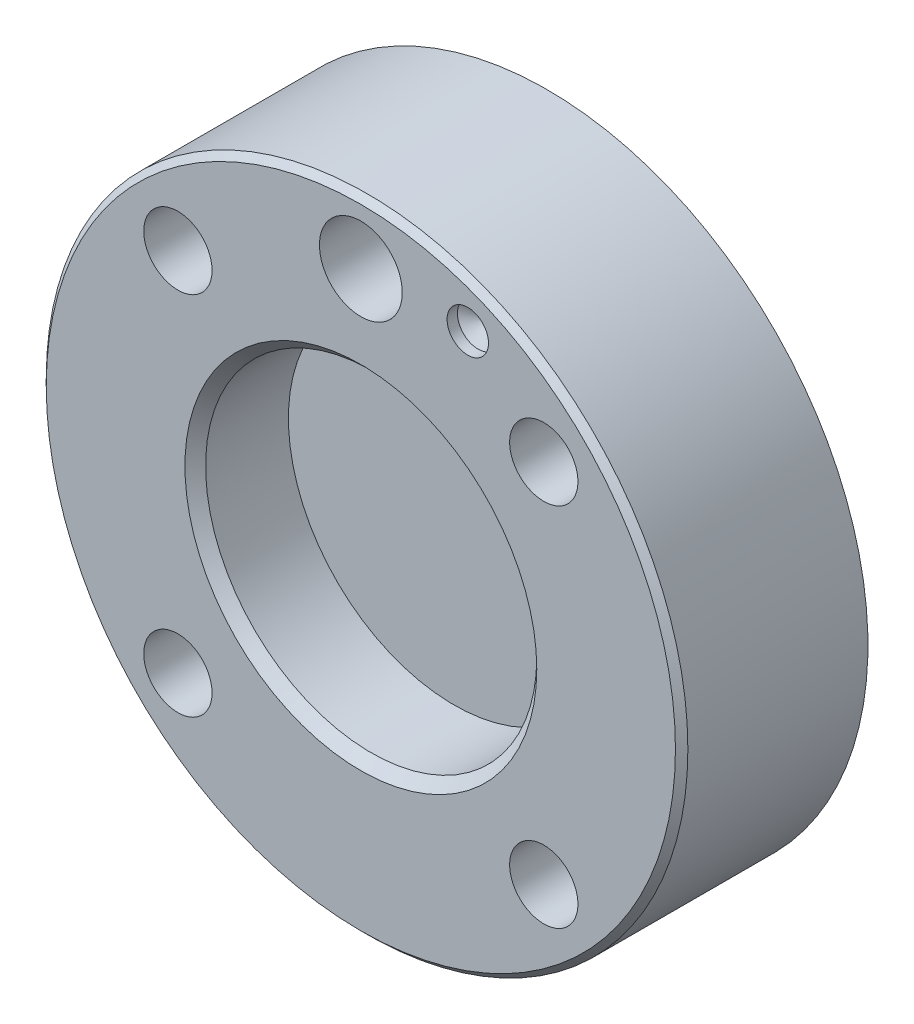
ISO-10303-21;
HEADER;
FILE_DESCRIPTION(('STEP AP214'),'2;1');
FILE_NAME('part.step','',(''),(''),'','','');
FILE_SCHEMA(('AUTOMOTIVE_DESIGN { 1 0 10303 214 1 1 1 1 }'));
ENDSEC;
DATA;
#1=APPLICATION_CONTEXT('core data for automotive mechanical design processes');
#2=APPLICATION_PROTOCOL_DEFINITION('international standard','automotive_design',2000,#1);
#3=PRODUCT_CONTEXT('',#1,'mechanical');
#4=PRODUCT('Part','Part','',(#3));
#5=PRODUCT_RELATED_PRODUCT_CATEGORY('part','',(#4));
#6=PRODUCT_DEFINITION_FORMATION('','',#4);
#7=PRODUCT_DEFINITION_CONTEXT('part definition',#1,'design');
#8=PRODUCT_DEFINITION('design','',#6,#7);
#9=PRODUCT_DEFINITION_SHAPE('','',#8);
#10=(LENGTH_UNIT() NAMED_UNIT(*) SI_UNIT(.MILLI.,.METRE.));
#11=(NAMED_UNIT(*) PLANE_ANGLE_UNIT() SI_UNIT($,.RADIAN.));
#12=(NAMED_UNIT(*) SI_UNIT($,.STERADIAN.) SOLID_ANGLE_UNIT());
#13=UNCERTAINTY_MEASURE_WITH_UNIT(LENGTH_MEASURE(1.E-05),#10,'distance_accuracy_value','');
#14=(GEOMETRIC_REPRESENTATION_CONTEXT(3) GLOBAL_UNCERTAINTY_ASSIGNED_CONTEXT((#13)) GLOBAL_UNIT_ASSIGNED_CONTEXT((#10,
#11,#12)) REPRESENTATION_CONTEXT('',''));
#15=CARTESIAN_POINT('',(0.,0.,0.));
#16=DIRECTION('',(0.,0.,1.));
#17=DIRECTION('',(1.,0.,0.));
#18=AXIS2_PLACEMENT_3D('',#15,#16,#17);
#19=CARTESIAN_POINT('',(5.5,0.,31.5));
#20=DIRECTION('',(0.,0.,1.));
#21=DIRECTION('',(1.,0.,0.));
#22=AXIS2_PLACEMENT_3D('',#19,#20,#21);
#23=PLANE('',#22);
#24=CARTESIAN_POINT('',(0.,0.,31.5));
#25=DIRECTION('',(0.,0.,1.));
#26=DIRECTION('',(1.,0.,0.));
#27=AXIS2_PLACEMENT_3D('',#24,#25,#26);
#28=CIRCLE('',#27,8.);
#29=CARTESIAN_POINT('',(7.99999999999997,0.,31.5));
#30=VERTEX_POINT('',#29);
#31=EDGE_CURVE('E41',#30,#30,#28,.T.);
#32=ORIENTED_EDGE('',*,*,#31,.T.);
#33=EDGE_LOOP('',(#32));
#34=FACE_BOUND('',#33,.T.);
#35=ADVANCED_FACE('F38',(#34),#23,.T.);
#36=CARTESIAN_POINT('',(0.,0.,11.5));
#37=DIRECTION('',(0.,0.,1.));
#38=DIRECTION('',(1.,0.,0.));
#39=AXIS2_PLACEMENT_3D('',#36,#37,#38);
#40=CYLINDRICAL_SURFACE('',#39,8.);
#41=ORIENTED_EDGE('',*,*,#31,.F.);
#42=EDGE_LOOP('',(#41));
#43=FACE_BOUND('',#42,.T.);
#44=CARTESIAN_POINT('',(0.,0.,35.5));
#45=DIRECTION('',(0.,0.,1.));
#46=DIRECTION('',(1.,0.,0.));
#47=AXIS2_PLACEMENT_3D('',#44,#45,#46);
#48=CIRCLE('',#47,8.);
#49=CARTESIAN_POINT('',(7.99999999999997,0.,35.5));
#50=VERTEX_POINT('',#49);
#51=EDGE_CURVE('E116',#50,#50,#48,.T.);
#52=ORIENTED_EDGE('',*,*,#51,.T.);
#53=EDGE_LOOP('',(#52));
#54=FACE_BOUND('',#53,.T.);
#55=ADVANCED_FACE('F130',(#43,#54),#40,.F.);
#56=CARTESIAN_POINT('',(0.,0.,36.0000000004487));
#57=DIRECTION('',(0.,0.,1.));
#58=DIRECTION('',(1.,0.,0.));
#59=AXIS2_PLACEMENT_3D('',#56,#57,#58);
#60=CONICAL_SURFACE('',#59,8.49999999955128,0.785398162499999);
#61=ORIENTED_EDGE('',*,*,#51,.F.);
#62=EDGE_LOOP('',(#61));
#63=FACE_BOUND('',#62,.T.);
#64=CARTESIAN_POINT('',(0.,0.,36.0000000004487));
#65=DIRECTION('',(0.,0.,1.));
#66=DIRECTION('',(1.,0.,0.));
#67=AXIS2_PLACEMENT_3D('',#64,#65,#66);
#68=CIRCLE('',#67,8.49999999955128);
#69=CARTESIAN_POINT('',(8.49999999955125,0.,36.0000000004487));
#70=VERTEX_POINT('',#69);
#71=EDGE_CURVE('E119',#70,#70,#68,.F.);
#72=ORIENTED_EDGE('',*,*,#71,.F.);
#73=EDGE_LOOP('',(#72));
#74=FACE_BOUND('',#73,.T.);
#75=ADVANCED_FACE('F128',(#63,#74),#60,.F.);
#76=CARTESIAN_POINT('',(8.,0.,36.));
#77=DIRECTION('',(0.,0.,1.));
#78=DIRECTION('',(1.,0.,0.));
#79=AXIS2_PLACEMENT_3D('',#76,#77,#78);
#80=PLANE('',#79);
#81=CARTESIAN_POINT('',(0.,12.5000000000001,36.));
#82=DIRECTION('',(0.,0.,1.));
#83=DIRECTION('',(1.,0.,0.));
#84=AXIS2_PLACEMENT_3D('',#81,#82,#83);
#85=CIRCLE('',#84,1.99999999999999);
#86=CARTESIAN_POINT('',(1.99999999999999,12.5000000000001,36.));
#87=VERTEX_POINT('',#86);
#88=EDGE_CURVE('E77',#87,#87,#85,.T.);
#89=ORIENTED_EDGE('',*,*,#88,.F.);
#90=EDGE_LOOP('',(#89));
#91=FACE_BOUND('',#90,.T.);
#92=CARTESIAN_POINT('',(-8.83883476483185,8.83883476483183,36.));
#93=DIRECTION('',(0.,0.,1.));
#94=DIRECTION('',(1.,0.,0.));
#95=AXIS2_PLACEMENT_3D('',#92,#93,#94);
#96=CIRCLE('',#95,1.64999999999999);
#97=CARTESIAN_POINT('',(-7.18883476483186,8.83883476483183,36.));
#98=VERTEX_POINT('',#97);
#99=EDGE_CURVE('E76',#98,#98,#96,.T.);
#100=ORIENTED_EDGE('',*,*,#99,.F.);
#101=EDGE_LOOP('',(#100));
#102=FACE_BOUND('',#101,.T.);
#103=CARTESIAN_POINT('',(8.83883476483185,8.83883476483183,36.0000000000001));
#104=DIRECTION('',(0.,0.,1.));
#105=DIRECTION('',(1.,0.,0.));
#106=AXIS2_PLACEMENT_3D('',#103,#104,#105);
#107=CIRCLE('',#106,1.64999999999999);
#108=CARTESIAN_POINT('',(10.4888347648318,8.83883476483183,36.0000000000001));
#109=VERTEX_POINT('',#108);
#110=EDGE_CURVE('E87',#109,#109,#107,.T.);
#111=ORIENTED_EDGE('',*,*,#110,.F.);
#112=EDGE_LOOP('',(#111));
#113=FACE_BOUND('',#112,.T.);
#114=CARTESIAN_POINT('',(8.83883476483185,-8.83883476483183,36.));
#115=DIRECTION('',(0.,0.,1.));
#116=DIRECTION('',(1.,0.,0.));
#117=AXIS2_PLACEMENT_3D('',#114,#115,#116);
#118=CIRCLE('',#117,1.64999999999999);
#119=CARTESIAN_POINT('',(10.4888347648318,-8.83883476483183,36.));
#120=VERTEX_POINT('',#119);
#121=EDGE_CURVE('E93',#120,#120,#118,.T.);
#122=ORIENTED_EDGE('',*,*,#121,.F.);
#123=EDGE_LOOP('',(#122));
#124=FACE_BOUND('',#123,.T.);
#125=CARTESIAN_POINT('',(-8.83883476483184,-8.83883476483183,36.));
#126=DIRECTION('',(0.,0.,1.));
#127=DIRECTION('',(1.,0.,0.));
#128=AXIS2_PLACEMENT_3D('',#125,#126,#127);
#129=CIRCLE('',#128,1.64999999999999);
#130=CARTESIAN_POINT('',(-7.18883476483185,-8.83883476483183,36.));
#131=VERTEX_POINT('',#130);
#132=EDGE_CURVE('E99',#131,#131,#129,.T.);
#133=ORIENTED_EDGE('',*,*,#132,.F.);
#134=EDGE_LOOP('',(#133));
#135=FACE_BOUND('',#134,.T.);
#136=CARTESIAN_POINT('',(5.16622633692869,12.4723736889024,36.));
#137=DIRECTION('',(0.,0.,1.));
#138=DIRECTION('',(1.,0.,0.));
#139=AXIS2_PLACEMENT_3D('',#136,#137,#138);
#140=CIRCLE('',#139,1.);
#141=CARTESIAN_POINT('',(6.16622633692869,12.4723736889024,36.));
#142=VERTEX_POINT('',#141);
#143=EDGE_CURVE('E108',#142,#142,#140,.T.);
#144=ORIENTED_EDGE('',*,*,#143,.F.);
#145=EDGE_LOOP('',(#144));
#146=FACE_BOUND('',#145,.T.);
#147=CARTESIAN_POINT('',(0.,0.,36.));
#148=DIRECTION('',(0.,0.,-1.));
#149=DIRECTION('',(-1.,0.,0.));
#150=AXIS2_PLACEMENT_3D('',#147,#148,#149);
#151=CIRCLE('',#150,15.2);
#152=CARTESIAN_POINT('',(-15.2,0.,36.));
#153=VERTEX_POINT('',#152);
#154=EDGE_CURVE('E46',#153,#153,#151,.T.);
#155=ORIENTED_EDGE('',*,*,#154,.F.);
#156=EDGE_LOOP('',(#155));
#157=FACE_BOUND('',#156,.T.);
#158=ORIENTED_EDGE('',*,*,#71,.T.);
#159=EDGE_LOOP('',(#158));
#160=FACE_BOUND('',#159,.T.);
#161=ADVANCED_FACE('F126',(#91,#102,#113,#124,#135,#146,#157,#160),#80,.T.);
#162=CARTESIAN_POINT('',(0.,0.,35.6999999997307));
#163=DIRECTION('',(0.,0.,-1.));
#164=DIRECTION('',(-1.,0.,0.));
#165=AXIS2_PLACEMENT_3D('',#162,#163,#164);
#166=CONICAL_SURFACE('',#165,15.4999999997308,0.7853981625);
#167=ORIENTED_EDGE('',*,*,#154,.T.);
#168=EDGE_LOOP('',(#167));
#169=FACE_BOUND('',#168,.T.);
#170=CARTESIAN_POINT('',(0.,0.,35.7));
#171=DIRECTION('',(0.,0.,1.));
#172=DIRECTION('',(1.,0.,0.));
#173=AXIS2_PLACEMENT_3D('',#170,#171,#172);
#174=CIRCLE('',#173,15.5);
#175=CARTESIAN_POINT('',(15.5,0.,35.7));
#176=VERTEX_POINT('',#175);
#177=EDGE_CURVE('E11',#176,#176,#174,.F.);
#178=ORIENTED_EDGE('',*,*,#177,.F.);
#179=EDGE_LOOP('',(#178));
#180=FACE_BOUND('',#179,.T.);
#181=ADVANCED_FACE('F137',(#169,#180),#166,.T.);
#182=CARTESIAN_POINT('',(0.,0.,11.5));
#183=DIRECTION('',(0.,0.,1.));
#184=DIRECTION('',(1.,0.,0.));
#185=AXIS2_PLACEMENT_3D('',#182,#183,#184);
#186=CYLINDRICAL_SURFACE('',#185,15.5);
#187=ORIENTED_EDGE('',*,*,#177,.T.);
#188=EDGE_LOOP('',(#187));
#189=FACE_BOUND('',#188,.T.);
#190=CARTESIAN_POINT('',(0.,0.,27.));
#191=DIRECTION('',(0.,0.,-1.));
#192=DIRECTION('',(-1.,0.,0.));
#193=AXIS2_PLACEMENT_3D('',#190,#191,#192);
#194=CIRCLE('',#193,15.5);
#195=CARTESIAN_POINT('',(-15.5,0.,27.));
#196=VERTEX_POINT('',#195);
#197=EDGE_CURVE('E105',#196,#196,#194,.T.);
#198=ORIENTED_EDGE('',*,*,#197,.F.);
#199=EDGE_LOOP('',(#198));
#200=FACE_BOUND('',#199,.T.);
#201=ADVANCED_FACE('F142',(#189,#200),#186,.T.);
#202=CARTESIAN_POINT('',(5.16622633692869,12.4723736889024,35.5));
#203=DIRECTION('',(0.,0.,1.));
#204=DIRECTION('',(1.,0.,0.));
#205=AXIS2_PLACEMENT_3D('',#202,#203,#204);
#206=CONICAL_SURFACE('',#205,1.,1.02974425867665);
#207=CARTESIAN_POINT('',(5.16622633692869,12.4723736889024,34.8991393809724));
#208=VERTEX_POINT('',#207);
#209=VERTEX_LOOP('',#208);
#210=FACE_BOUND('',#209,.T.);
#211=CARTESIAN_POINT('',(5.16622633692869,12.4723736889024,35.5));
#212=DIRECTION('',(0.,0.,1.));
#213=DIRECTION('',(1.,0.,0.));
#214=AXIS2_PLACEMENT_3D('',#211,#212,#213);
#215=CIRCLE('',#214,1.);
#216=CARTESIAN_POINT('',(6.16622633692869,12.4723736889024,35.5));
#217=VERTEX_POINT('',#216);
#218=EDGE_CURVE('E111',#217,#217,#215,.T.);
#219=ORIENTED_EDGE('',*,*,#218,.T.);
#220=EDGE_LOOP('',(#219));
#221=FACE_BOUND('',#220,.T.);
#222=ADVANCED_FACE('F144',(#210,#221),#206,.F.);
#223=CARTESIAN_POINT('',(5.16622633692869,12.4723736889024,36.));
#224=DIRECTION('',(0.,0.,1.));
#225=DIRECTION('',(1.,0.,0.));
#226=AXIS2_PLACEMENT_3D('',#223,#224,#225);
#227=CYLINDRICAL_SURFACE('',#226,1.);
#228=ORIENTED_EDGE('',*,*,#218,.F.);
#229=EDGE_LOOP('',(#228));
#230=FACE_BOUND('',#229,.T.);
#231=ORIENTED_EDGE('',*,*,#143,.T.);
#232=EDGE_LOOP('',(#231));
#233=FACE_BOUND('',#232,.T.);
#234=ADVANCED_FACE('F151',(#230,#233),#227,.F.);
#235=CARTESIAN_POINT('',(0.,15.5,27.));
#236=DIRECTION('',(0.,0.,1.));
#237=DIRECTION('',(1.,0.,0.));
#238=AXIS2_PLACEMENT_3D('',#235,#236,#237);
#239=PLANE('',#238);
#240=ORIENTED_EDGE('',*,*,#197,.T.);
#241=EDGE_LOOP('',(#240));
#242=FACE_BOUND('',#241,.T.);
#243=ADVANCED_FACE('F159',(#242),#239,.F.);
#244=CARTESIAN_POINT('',(-8.83883476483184,-8.83883476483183,28.5));
#245=DIRECTION('',(0.,0.,1.));
#246=DIRECTION('',(1.,0.,0.));
#247=AXIS2_PLACEMENT_3D('',#244,#245,#246);
#248=CONICAL_SURFACE('',#247,1.65,1.02974425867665);
#249=CARTESIAN_POINT('',(-8.83883476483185,-8.83883476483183,27.5085799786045));
#250=VERTEX_POINT('',#249);
#251=VERTEX_LOOP('',#250);
#252=FACE_BOUND('',#251,.T.);
#253=CARTESIAN_POINT('',(-8.83883476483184,-8.83883476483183,28.5));
#254=DIRECTION('',(0.,0.,1.));
#255=DIRECTION('',(1.,0.,0.));
#256=AXIS2_PLACEMENT_3D('',#253,#254,#255);
#257=CIRCLE('',#256,1.65);
#258=CARTESIAN_POINT('',(-7.18883476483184,-8.83883476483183,28.5));
#259=VERTEX_POINT('',#258);
#260=EDGE_CURVE('E102',#259,#259,#257,.T.);
#261=ORIENTED_EDGE('',*,*,#260,.T.);
#262=EDGE_LOOP('',(#261));
#263=FACE_BOUND('',#262,.T.);
#264=ADVANCED_FACE('F163',(#252,#263),#248,.F.);
#265=CARTESIAN_POINT('',(-8.83883476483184,-8.83883476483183,36.));
#266=DIRECTION('',(0.,0.,1.));
#267=DIRECTION('',(1.,0.,0.));
#268=AXIS2_PLACEMENT_3D('',#265,#266,#267);
#269=CYLINDRICAL_SURFACE('',#268,1.64999999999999);
#270=ORIENTED_EDGE('',*,*,#260,.F.);
#271=EDGE_LOOP('',(#270));
#272=FACE_BOUND('',#271,.T.);
#273=ORIENTED_EDGE('',*,*,#132,.T.);
#274=EDGE_LOOP('',(#273));
#275=FACE_BOUND('',#274,.T.);
#276=ADVANCED_FACE('F167',(#272,#275),#269,.F.);
#277=CARTESIAN_POINT('',(8.83883476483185,-8.83883476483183,28.5));
#278=DIRECTION('',(0.,0.,1.));
#279=DIRECTION('',(1.,0.,0.));
#280=AXIS2_PLACEMENT_3D('',#277,#278,#279);
#281=CONICAL_SURFACE('',#280,1.65,1.02974425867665);
#282=CARTESIAN_POINT('',(8.83883476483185,-8.83883476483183,27.5085799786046));
#283=VERTEX_POINT('',#282);
#284=VERTEX_LOOP('',#283);
#285=FACE_BOUND('',#284,.T.);
#286=CARTESIAN_POINT('',(8.83883476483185,-8.83883476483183,28.5));
#287=DIRECTION('',(0.,0.,1.));
#288=DIRECTION('',(1.,0.,0.));
#289=AXIS2_PLACEMENT_3D('',#286,#287,#288);
#290=CIRCLE('',#289,1.65);
#291=CARTESIAN_POINT('',(10.4888347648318,-8.83883476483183,28.5));
#292=VERTEX_POINT('',#291);
#293=EDGE_CURVE('E96',#292,#292,#290,.T.);
#294=ORIENTED_EDGE('',*,*,#293,.T.);
#295=EDGE_LOOP('',(#294));
#296=FACE_BOUND('',#295,.T.);
#297=ADVANCED_FACE('F170',(#285,#296),#281,.F.);
#298=CARTESIAN_POINT('',(8.83883476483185,-8.83883476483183,36.));
#299=DIRECTION('',(0.,0.,1.));
#300=DIRECTION('',(1.,0.,0.));
#301=AXIS2_PLACEMENT_3D('',#298,#299,#300);
#302=CYLINDRICAL_SURFACE('',#301,1.64999999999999);
#303=ORIENTED_EDGE('',*,*,#293,.F.);
#304=EDGE_LOOP('',(#303));
#305=FACE_BOUND('',#304,.T.);
#306=ORIENTED_EDGE('',*,*,#121,.T.);
#307=EDGE_LOOP('',(#306));
#308=FACE_BOUND('',#307,.T.);
#309=ADVANCED_FACE('F174',(#305,#308),#302,.F.);
#310=CARTESIAN_POINT('',(8.83883476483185,8.83883476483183,28.5000000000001));
#311=DIRECTION('',(0.,0.,1.));
#312=DIRECTION('',(1.,0.,0.));
#313=AXIS2_PLACEMENT_3D('',#310,#311,#312);
#314=CONICAL_SURFACE('',#313,1.65,1.02974425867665);
#315=CARTESIAN_POINT('',(8.83883476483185,8.83883476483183,27.5085799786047));
#316=VERTEX_POINT('',#315);
#317=VERTEX_LOOP('',#316);
#318=FACE_BOUND('',#317,.T.);
#319=CARTESIAN_POINT('',(8.83883476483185,8.83883476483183,28.5000000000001));
#320=DIRECTION('',(0.,0.,1.));
#321=DIRECTION('',(1.,0.,0.));
#322=AXIS2_PLACEMENT_3D('',#319,#320,#321);
#323=CIRCLE('',#322,1.65);
#324=CARTESIAN_POINT('',(10.4888347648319,8.83883476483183,28.5000000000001));
#325=VERTEX_POINT('',#324);
#326=EDGE_CURVE('E90',#325,#325,#323,.T.);
#327=ORIENTED_EDGE('',*,*,#326,.T.);
#328=EDGE_LOOP('',(#327));
#329=FACE_BOUND('',#328,.T.);
#330=ADVANCED_FACE('F178',(#318,#329),#314,.F.);
#331=CARTESIAN_POINT('',(8.83883476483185,8.83883476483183,36.0000000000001));
#332=DIRECTION('',(0.,0.,1.));
#333=DIRECTION('',(1.,0.,0.));
#334=AXIS2_PLACEMENT_3D('',#331,#332,#333);
#335=CYLINDRICAL_SURFACE('',#334,1.64999999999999);
#336=ORIENTED_EDGE('',*,*,#326,.F.);
#337=EDGE_LOOP('',(#336));
#338=FACE_BOUND('',#337,.T.);
#339=ORIENTED_EDGE('',*,*,#110,.T.);
#340=EDGE_LOOP('',(#339));
#341=FACE_BOUND('',#340,.T.);
#342=ADVANCED_FACE('F182',(#338,#341),#335,.F.);
#343=CARTESIAN_POINT('',(-8.83883476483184,8.83883476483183,28.5));
#344=DIRECTION('',(0.,0.,1.));
#345=DIRECTION('',(1.,0.,0.));
#346=AXIS2_PLACEMENT_3D('',#343,#344,#345);
#347=CONICAL_SURFACE('',#346,1.65,1.02974425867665);
#348=CARTESIAN_POINT('',(-8.83883476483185,8.83883476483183,27.5085799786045));
#349=VERTEX_POINT('',#348);
#350=VERTEX_LOOP('',#349);
#351=FACE_BOUND('',#350,.T.);
#352=CARTESIAN_POINT('',(-8.83883476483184,8.83883476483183,28.5));
#353=DIRECTION('',(0.,0.,1.));
#354=DIRECTION('',(1.,0.,0.));
#355=AXIS2_PLACEMENT_3D('',#352,#353,#354);
#356=CIRCLE('',#355,1.65);
#357=CARTESIAN_POINT('',(-7.18883476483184,8.83883476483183,28.5));
#358=VERTEX_POINT('',#357);
#359=EDGE_CURVE('E80',#358,#358,#356,.T.);
#360=ORIENTED_EDGE('',*,*,#359,.T.);
#361=EDGE_LOOP('',(#360));
#362=FACE_BOUND('',#361,.T.);
#363=ADVANCED_FACE('F186',(#351,#362),#347,.F.);
#364=CARTESIAN_POINT('',(-8.83883476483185,8.83883476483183,36.));
#365=DIRECTION('',(0.,0.,1.));
#366=DIRECTION('',(1.,0.,0.));
#367=AXIS2_PLACEMENT_3D('',#364,#365,#366);
#368=CYLINDRICAL_SURFACE('',#367,1.64999999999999);
#369=ORIENTED_EDGE('',*,*,#359,.F.);
#370=EDGE_LOOP('',(#369));
#371=FACE_BOUND('',#370,.T.);
#372=ORIENTED_EDGE('',*,*,#99,.T.);
#373=EDGE_LOOP('',(#372));
#374=FACE_BOUND('',#373,.T.);
#375=ADVANCED_FACE('F70',(#371,#374),#368,.F.);
#376=CARTESIAN_POINT('',(0.,12.5000000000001,32.));
#377=DIRECTION('',(0.,0.,1.));
#378=DIRECTION('',(1.,0.,0.));
#379=AXIS2_PLACEMENT_3D('',#376,#377,#378);
#380=CONICAL_SURFACE('',#379,1.99999999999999,1.02974425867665);
#381=CARTESIAN_POINT('',(0.,12.5000000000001,30.7982787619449));
#382=VERTEX_POINT('',#381);
#383=VERTEX_LOOP('',#382);
#384=FACE_BOUND('',#383,.T.);
#385=CARTESIAN_POINT('',(0.,12.5000000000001,32.));
#386=DIRECTION('',(0.,0.,1.));
#387=DIRECTION('',(1.,0.,0.));
#388=AXIS2_PLACEMENT_3D('',#385,#386,#387);
#389=CIRCLE('',#388,1.99999999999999);
#390=CARTESIAN_POINT('',(1.99999999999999,12.5000000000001,32.));
#391=VERTEX_POINT('',#390);
#392=EDGE_CURVE('E74',#391,#391,#389,.T.);
#393=ORIENTED_EDGE('',*,*,#392,.T.);
#394=EDGE_LOOP('',(#393));
#395=FACE_BOUND('',#394,.T.);
#396=ADVANCED_FACE('F66',(#384,#395),#380,.F.);
#397=CARTESIAN_POINT('',(0.,12.5000000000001,36.));
#398=DIRECTION('',(0.,0.,1.));
#399=DIRECTION('',(1.,0.,0.));
#400=AXIS2_PLACEMENT_3D('',#397,#398,#399);
#401=CYLINDRICAL_SURFACE('',#400,1.99999999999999);
#402=ORIENTED_EDGE('',*,*,#392,.F.);
#403=EDGE_LOOP('',(#402));
#404=FACE_BOUND('',#403,.T.);
#405=ORIENTED_EDGE('',*,*,#88,.T.);
#406=EDGE_LOOP('',(#405));
#407=FACE_BOUND('',#406,.T.);
#408=ADVANCED_FACE('F69',(#404,#407),#401,.F.);
#409=CLOSED_SHELL('',(#35,#55,#75,#161,#181,#201,#222,#234,#243,#264,#276,#297,#309,#330,#342,
#363,#375,#396,#408));
#410=MANIFOLD_SOLID_BREP('B2',#409);
#411=ADVANCED_BREP_SHAPE_REPRESENTATION('',(#18,#410),#14);
#412=SHAPE_DEFINITION_REPRESENTATION(#9,#411);
ENDSEC;
END-ISO-10303-21;
